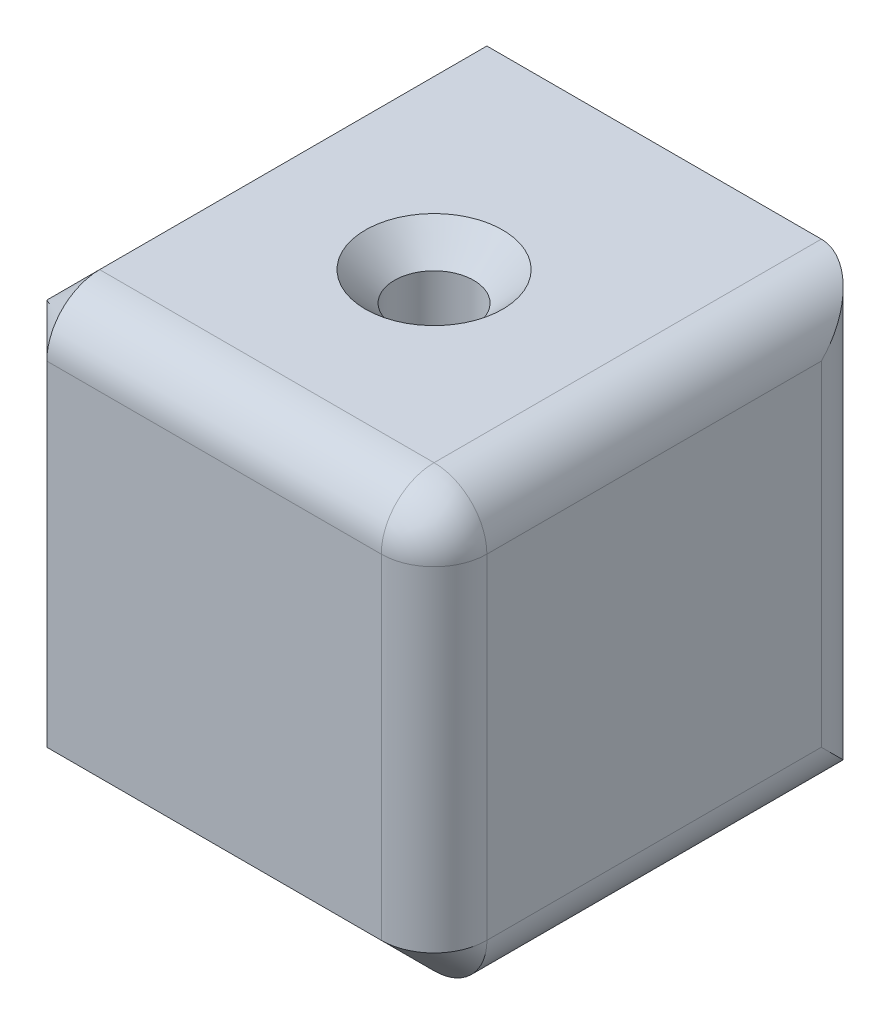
ISO-10303-21;
HEADER;
FILE_DESCRIPTION(('STEP AP214'),'2;1');
FILE_NAME('part.step','',(''),(''),'','','');
FILE_SCHEMA(('AUTOMOTIVE_DESIGN { 1 0 10303 214 1 1 1 1 }'));
ENDSEC;
DATA;
#1=APPLICATION_CONTEXT('core data for automotive mechanical design processes');
#2=APPLICATION_PROTOCOL_DEFINITION('international standard','automotive_design',2000,#1);
#3=PRODUCT_CONTEXT('',#1,'mechanical');
#4=PRODUCT('Part','Part','',(#3));
#5=PRODUCT_RELATED_PRODUCT_CATEGORY('part','',(#4));
#6=PRODUCT_DEFINITION_FORMATION('','',#4);
#7=PRODUCT_DEFINITION_CONTEXT('part definition',#1,'design');
#8=PRODUCT_DEFINITION('design','',#6,#7);
#9=PRODUCT_DEFINITION_SHAPE('','',#8);
#10=(LENGTH_UNIT() NAMED_UNIT(*) SI_UNIT(.MILLI.,.METRE.));
#11=(NAMED_UNIT(*) PLANE_ANGLE_UNIT() SI_UNIT($,.RADIAN.));
#12=(NAMED_UNIT(*) SI_UNIT($,.STERADIAN.) SOLID_ANGLE_UNIT());
#13=UNCERTAINTY_MEASURE_WITH_UNIT(LENGTH_MEASURE(1.E-05),#10,'distance_accuracy_value','');
#14=(GEOMETRIC_REPRESENTATION_CONTEXT(3) GLOBAL_UNCERTAINTY_ASSIGNED_CONTEXT((#13)) GLOBAL_UNIT_ASSIGNED_CONTEXT((#10,
#11,#12)) REPRESENTATION_CONTEXT('',''));
#15=CARTESIAN_POINT('',(0.,0.,0.));
#16=DIRECTION('',(0.,0.,1.));
#17=DIRECTION('',(1.,0.,0.));
#18=AXIS2_PLACEMENT_3D('',#15,#16,#17);
#19=CARTESIAN_POINT('',(0.,0.,25.));
#20=DIRECTION('',(1.,0.,0.));
#21=DIRECTION('',(0.,0.,-1.));
#22=AXIS2_PLACEMENT_3D('',#19,#20,#21);
#23=PLANE('',#22);
#24=DIRECTION('',(0.,0.,-1.));
#25=VECTOR('',#24,1.);
#26=CARTESIAN_POINT('',(0.,22.,25.));
#27=LINE('',#26,#25);
#28=CARTESIAN_POINT('',(0.,22.,22.));
#29=VERTEX_POINT('',#28);
#30=CARTESIAN_POINT('',(0.,22.,2.));
#31=VERTEX_POINT('',#30);
#32=EDGE_CURVE('E206',#29,#31,#27,.T.);
#33=ORIENTED_EDGE('',*,*,#32,.T.);
#34=CARTESIAN_POINT('',(0.,72.,2.));
#35=CARTESIAN_POINT('',(0.,55.3333333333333,2.));
#36=CARTESIAN_POINT('',(0.,38.6666666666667,2.));
#37=CARTESIAN_POINT('',(0.,22.,2.));
#38=CARTESIAN_POINT('',(0.,18.3333333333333,2.));
#39=CARTESIAN_POINT('',(0.,14.6666666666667,2.5));
#40=CARTESIAN_POINT('',(0.,11.,3.));
#41=CARTESIAN_POINT('',(0.,7.33333333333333,3.5));
#42=CARTESIAN_POINT('',(0.,3.66666666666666,4.));
#43=CARTESIAN_POINT('',(0.,0.,4.));
#44=CARTESIAN_POINT('',(0.,-16.,4.));
#45=CARTESIAN_POINT('',(0.,-32.,4.));
#46=CARTESIAN_POINT('',(0.,-48.,4.));
#47=(BOUNDED_CURVE() B_SPLINE_CURVE(3,(#34,#35,#36,#37,#38,#39,#40,#41,#42,#43,#44,#45,#46),
.UNSPECIFIED.,.F.,.F.) B_SPLINE_CURVE_WITH_KNOTS((4,3,3,3,4),(-0.072,-0.022,-0.011,0.,0.048),
.UNSPECIFIED.) CURVE() GEOMETRIC_REPRESENTATION_ITEM() RATIONAL_B_SPLINE_CURVE((1.,1.,1.,1.,1.,
1.,1.,1.,1.,1.,1.,1.,1.)) REPRESENTATION_ITEM(''));
#48=CARTESIAN_POINT('',(0.,0.,4.));
#49=VERTEX_POINT('',#48);
#50=EDGE_CURVE('E333',#31,#49,#47,.T.);
#51=ORIENTED_EDGE('',*,*,#50,.T.);
#52=DIRECTION('',(0.,0.,-1.));
#53=VECTOR('',#52,1.);
#54=CARTESIAN_POINT('',(0.,0.,25.));
#55=LINE('',#54,#53);
#56=CARTESIAN_POINT('',(0.,0.,22.));
#57=VERTEX_POINT('',#56);
#58=EDGE_CURVE('E151',#57,#49,#55,.T.);
#59=ORIENTED_EDGE('',*,*,#58,.F.);
#60=DIRECTION('',(0.,1.,0.));
#61=VECTOR('',#60,1.);
#62=CARTESIAN_POINT('',(0.,0.,22.));
#63=LINE('',#62,#61);
#64=EDGE_CURVE('E187',#57,#29,#63,.T.);
#65=ORIENTED_EDGE('',*,*,#64,.T.);
#66=EDGE_LOOP('',(#33,#51,#59,#65));
#67=FACE_BOUND('',#66,.T.);
#68=ADVANCED_FACE('F43',(#67),#23,.F.);
#69=CARTESIAN_POINT('',(0.,0.,25.));
#70=DIRECTION('',(0.,1.,0.));
#71=DIRECTION('',(0.,0.,1.));
#72=AXIS2_PLACEMENT_3D('',#69,#70,#71);
#73=PLANE('',#72);
#74=CARTESIAN_POINT('',(12.5,0.,12.5));
#75=DIRECTION('',(0.,1.,0.));
#76=DIRECTION('',(0.,0.,1.));
#77=AXIS2_PLACEMENT_3D('',#74,#75,#76);
#78=CIRCLE('',#77,2.25);
#79=CARTESIAN_POINT('',(12.5,0.,14.75));
#80=VERTEX_POINT('',#79);
#81=EDGE_CURVE('E234',#80,#80,#78,.T.);
#82=ORIENTED_EDGE('',*,*,#81,.T.);
#83=EDGE_LOOP('',(#82));
#84=FACE_BOUND('',#83,.T.);
#85=ORIENTED_EDGE('',*,*,#58,.T.);
#86=CARTESIAN_POINT('',(0.,0.,4.));
#87=CARTESIAN_POINT('',(-1.07801650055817E-05,0.,3.88749351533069));
#88=CARTESIAN_POINT('',(0.00474660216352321,0.,3.77499214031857));
#89=CARTESIAN_POINT('',(0.0237142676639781,0.,3.55079431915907));
#90=CARTESIAN_POINT('',(0.0379240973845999,0.,3.43909783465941));
#91=CARTESIAN_POINT('',(0.075698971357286,0.,3.2173773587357));
#92=CARTESIAN_POINT('',(0.0992569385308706,0.,3.10735216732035));
#93=CARTESIAN_POINT('',(0.155536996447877,0.,2.88970424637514));
#94=CARTESIAN_POINT('',(0.188258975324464,0.,2.78208148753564));
#95=CARTESIAN_POINT('',(0.299906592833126,0.,2.4638552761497));
#96=CARTESIAN_POINT('',(0.392329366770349,0.,2.2578036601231));
#97=CARTESIAN_POINT('',(0.610395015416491,0.,1.8642930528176));
#98=CARTESIAN_POINT('',(0.73603203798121,0.,1.67683079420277));
#99=CARTESIAN_POINT('',(1.01700181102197,0.,1.325628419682));
#100=CARTESIAN_POINT('',(1.17233427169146,0.,1.16188807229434));
#101=CARTESIAN_POINT('',(1.50831732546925,0.,0.862784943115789));
#102=CARTESIAN_POINT('',(1.68897286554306,0.,0.727427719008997));
#103=CARTESIAN_POINT('',(2.07046311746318,0.,0.488943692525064));
#104=CARTESIAN_POINT('',(2.27130176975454,0.,0.38582320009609));
#105=CARTESIAN_POINT('',(2.68740125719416,0.,0.214817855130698));
#106=CARTESIAN_POINT('',(2.90265356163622,0.,0.146912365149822));
#107=CARTESIAN_POINT('',(3.2660192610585,0.,0.0651394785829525));
#108=CARTESIAN_POINT('',(3.41184681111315,0.,0.0407269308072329));
#109=CARTESIAN_POINT('',(3.70509586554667,0.,0.00815932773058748));
#110=CARTESIAN_POINT('',(3.8525148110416,0.,-1.87754480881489E-05));
#111=CARTESIAN_POINT('',(4.,0.,0.));
#112=B_SPLINE_CURVE_WITH_KNOTS('',3,(#86,#87,#88,#89,#90,#91,#92,#93,#94,#95,#96,#97,#98,#99,
#100,#101,#102,#103,#104,#105,#106,#107,#108,#109,#110,#111),.UNSPECIFIED.,.F.,.F.,(4,2,2,2,2,2,
2,2,2,2,2,2,4),(0.,0.337409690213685,0.674803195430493,1.01194176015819,1.34907620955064,
2.0230739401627,2.69695299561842,3.37082547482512,4.04482978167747,4.71896593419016,
5.39270656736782,5.83543557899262,6.27753560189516),.UNSPECIFIED.);
#113=CARTESIAN_POINT('',(4.,0.,0.));
#114=VERTEX_POINT('',#113);
#115=EDGE_CURVE('E75',#49,#114,#112,.T.);
#116=ORIENTED_EDGE('',*,*,#115,.T.);
#117=DIRECTION('',(1.,0.,0.));
#118=VECTOR('',#117,1.);
#119=CARTESIAN_POINT('',(0.,0.,0.));
#120=LINE('',#119,#118);
#121=CARTESIAN_POINT('',(22.,0.,0.));
#122=VERTEX_POINT('',#121);
#123=EDGE_CURVE('E231',#114,#122,#120,.T.);
#124=ORIENTED_EDGE('',*,*,#123,.T.);
#125=DIRECTION('',(0.,0.,-1.));
#126=VECTOR('',#125,1.);
#127=CARTESIAN_POINT('',(22.,0.,25.));
#128=LINE('',#127,#126);
#129=CARTESIAN_POINT('',(22.,0.,22.));
#130=VERTEX_POINT('',#129);
#131=EDGE_CURVE('E136',#122,#130,#128,.F.);
#132=ORIENTED_EDGE('',*,*,#131,.T.);
#133=DIRECTION('',(-1.,0.,0.));
#134=VECTOR('',#133,1.);
#135=CARTESIAN_POINT('',(0.,0.,22.));
#136=LINE('',#135,#134);
#137=EDGE_CURVE('E344',#130,#57,#136,.T.);
#138=ORIENTED_EDGE('',*,*,#137,.T.);
#139=EDGE_LOOP('',(#85,#116,#124,#132,#138));
#140=FACE_BOUND('',#139,.T.);
#141=ADVANCED_FACE('F356',(#84,#140),#73,.F.);
#142=CARTESIAN_POINT('',(25.,0.,25.));
#143=DIRECTION('',(-1.,0.,0.));
#144=DIRECTION('',(0.,0.,1.));
#145=AXIS2_PLACEMENT_3D('',#142,#143,#144);
#146=PLANE('',#145);
#147=DIRECTION('',(0.,1.,0.));
#148=VECTOR('',#147,1.);
#149=CARTESIAN_POINT('',(25.,0.,22.));
#150=LINE('',#149,#148);
#151=CARTESIAN_POINT('',(25.,22.,22.));
#152=VERTEX_POINT('',#151);
#153=CARTESIAN_POINT('',(25.,3.,22.));
#154=VERTEX_POINT('',#153);
#155=EDGE_CURVE('E156',#152,#154,#150,.F.);
#156=ORIENTED_EDGE('',*,*,#155,.T.);
#157=DIRECTION('',(0.,0.,-1.));
#158=VECTOR('',#157,1.);
#159=CARTESIAN_POINT('',(25.,3.,25.));
#160=LINE('',#159,#158);
#161=CARTESIAN_POINT('',(25.,3.,3.));
#162=VERTEX_POINT('',#161);
#163=EDGE_CURVE('E133',#154,#162,#160,.T.);
#164=ORIENTED_EDGE('',*,*,#163,.T.);
#165=DIRECTION('',(0.,1.,0.));
#166=VECTOR('',#165,1.);
#167=CARTESIAN_POINT('',(25.,25.,3.));
#168=LINE('',#167,#166);
#169=CARTESIAN_POINT('',(25.,22.,3.));
#170=VERTEX_POINT('',#169);
#171=EDGE_CURVE('E144',#162,#170,#168,.T.);
#172=ORIENTED_EDGE('',*,*,#171,.T.);
#173=DIRECTION('',(0.,0.,-1.));
#174=VECTOR('',#173,1.);
#175=CARTESIAN_POINT('',(25.,22.,25.));
#176=LINE('',#175,#174);
#177=EDGE_CURVE('E150',#170,#152,#176,.F.);
#178=ORIENTED_EDGE('',*,*,#177,.T.);
#179=EDGE_LOOP('',(#156,#164,#172,#178));
#180=FACE_BOUND('',#179,.T.);
#181=ADVANCED_FACE('F154',(#180),#146,.F.);
#182=CARTESIAN_POINT('',(0.,25.,25.));
#183=DIRECTION('',(0.,-1.,0.));
#184=DIRECTION('',(0.,0.,-1.));
#185=AXIS2_PLACEMENT_3D('',#182,#183,#184);
#186=PLANE('',#185);
#187=CARTESIAN_POINT('',(12.5,25.,12.5));
#188=DIRECTION('',(0.,1.,0.));
#189=DIRECTION('',(0.,0.,1.));
#190=AXIS2_PLACEMENT_3D('',#187,#188,#189);
#191=CIRCLE('',#190,3.9);
#192=CARTESIAN_POINT('',(12.5,25.,16.4));
#193=VERTEX_POINT('',#192);
#194=EDGE_CURVE('E203',#193,#193,#191,.T.);
#195=ORIENTED_EDGE('',*,*,#194,.F.);
#196=EDGE_LOOP('',(#195));
#197=FACE_BOUND('',#196,.T.);
#198=DIRECTION('',(-1.,0.,0.));
#199=VECTOR('',#198,1.);
#200=CARTESIAN_POINT('',(0.,25.,0.));
#201=LINE('',#200,#199);
#202=CARTESIAN_POINT('',(22.,25.,0.));
#203=VERTEX_POINT('',#202);
#204=CARTESIAN_POINT('',(3.00000000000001,25.,0.));
#205=VERTEX_POINT('',#204);
#206=EDGE_CURVE('E227',#203,#205,#201,.T.);
#207=ORIENTED_EDGE('',*,*,#206,.T.);
#208=DIRECTION('',(0.,0.,1.));
#209=VECTOR('',#208,1.);
#210=CARTESIAN_POINT('',(3.00000000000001,25.,25.));
#211=LINE('',#210,#209);
#212=CARTESIAN_POINT('',(3.00000000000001,25.,22.));
#213=VERTEX_POINT('',#212);
#214=EDGE_CURVE('E213',#205,#213,#211,.T.);
#215=ORIENTED_EDGE('',*,*,#214,.T.);
#216=DIRECTION('',(-1.,0.,0.));
#217=VECTOR('',#216,1.);
#218=CARTESIAN_POINT('',(0.,25.,22.));
#219=LINE('',#218,#217);
#220=CARTESIAN_POINT('',(22.,25.,22.));
#221=VERTEX_POINT('',#220);
#222=EDGE_CURVE('E173',#213,#221,#219,.F.);
#223=ORIENTED_EDGE('',*,*,#222,.T.);
#224=DIRECTION('',(0.,0.,-1.));
#225=VECTOR('',#224,1.);
#226=CARTESIAN_POINT('',(22.,25.,25.));
#227=LINE('',#226,#225);
#228=EDGE_CURVE('E181',#221,#203,#227,.T.);
#229=ORIENTED_EDGE('',*,*,#228,.T.);
#230=EDGE_LOOP('',(#207,#215,#223,#229));
#231=FACE_BOUND('',#230,.T.);
#232=ADVANCED_FACE('F248',(#197,#231),#186,.F.);
#233=CARTESIAN_POINT('',(0.,0.,25.));
#234=DIRECTION('',(0.,0.,-1.));
#235=DIRECTION('',(-1.,0.,0.));
#236=AXIS2_PLACEMENT_3D('',#233,#234,#235);
#237=PLANE('',#236);
#238=DIRECTION('',(-1.,0.,0.));
#239=VECTOR('',#238,1.);
#240=CARTESIAN_POINT('',(0.,22.,25.));
#241=LINE('',#240,#239);
#242=CARTESIAN_POINT('',(22.,22.,25.));
#243=VERTEX_POINT('',#242);
#244=CARTESIAN_POINT('',(3.00000000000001,22.,25.));
#245=VERTEX_POINT('',#244);
#246=EDGE_CURVE('E161',#243,#245,#241,.T.);
#247=ORIENTED_EDGE('',*,*,#246,.T.);
#248=DIRECTION('',(0.,-1.,0.));
#249=VECTOR('',#248,1.);
#250=CARTESIAN_POINT('',(3.00000000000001,0.,25.));
#251=LINE('',#250,#249);
#252=CARTESIAN_POINT('',(3.00000000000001,3.00000000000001,25.));
#253=VERTEX_POINT('',#252);
#254=EDGE_CURVE('E395',#245,#253,#251,.T.);
#255=ORIENTED_EDGE('',*,*,#254,.T.);
#256=DIRECTION('',(1.,0.,0.));
#257=VECTOR('',#256,1.);
#258=CARTESIAN_POINT('',(0.,3.00000000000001,25.));
#259=LINE('',#258,#257);
#260=CARTESIAN_POINT('',(22.,3.00000000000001,25.));
#261=VERTEX_POINT('',#260);
#262=EDGE_CURVE('E387',#253,#261,#259,.T.);
#263=ORIENTED_EDGE('',*,*,#262,.T.);
#264=DIRECTION('',(0.,1.,0.));
#265=VECTOR('',#264,1.);
#266=CARTESIAN_POINT('',(22.,0.,25.));
#267=LINE('',#266,#265);
#268=EDGE_CURVE('E169',#261,#243,#267,.T.);
#269=ORIENTED_EDGE('',*,*,#268,.T.);
#270=EDGE_LOOP('',(#247,#255,#263,#269));
#271=FACE_BOUND('',#270,.T.);
#272=ADVANCED_FACE('F251',(#271),#237,.F.);
#273=CARTESIAN_POINT('',(0.,0.,0.));
#274=DIRECTION('',(0.,0.,-1.));
#275=DIRECTION('',(-1.,0.,0.));
#276=AXIS2_PLACEMENT_3D('',#273,#274,#275);
#277=PLANE('',#276);
#278=ORIENTED_EDGE('',*,*,#123,.F.);
#279=CARTESIAN_POINT('',(2.,72.,0.));
#280=CARTESIAN_POINT('',(2.,55.3333333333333,0.));
#281=CARTESIAN_POINT('',(2.,38.6666666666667,0.));
#282=CARTESIAN_POINT('',(2.,22.,0.));
#283=CARTESIAN_POINT('',(2.,18.3333333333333,0.));
#284=CARTESIAN_POINT('',(2.5,14.6666666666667,0.));
#285=CARTESIAN_POINT('',(3.,11.,0.));
#286=CARTESIAN_POINT('',(3.5,7.33333333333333,0.));
#287=CARTESIAN_POINT('',(4.,3.66666666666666,0.));
#288=CARTESIAN_POINT('',(4.,0.,0.));
#289=CARTESIAN_POINT('',(4.,-16.,0.));
#290=CARTESIAN_POINT('',(4.,-32.,0.));
#291=CARTESIAN_POINT('',(4.,-48.,0.));
#292=(BOUNDED_CURVE() B_SPLINE_CURVE(3,(#279,#280,#281,#282,#283,#284,#285,#286,#287,#288,#289,
#290,#291),.UNSPECIFIED.,.F.,.F.) B_SPLINE_CURVE_WITH_KNOTS((4,3,3,3,4),(-0.072,-0.022,-0.011,
0.,0.048),.UNSPECIFIED.) CURVE() GEOMETRIC_REPRESENTATION_ITEM() RATIONAL_B_SPLINE_CURVE((1.,1.,
1.,1.,1.,1.,1.,1.,1.,1.,1.,1.,1.)) REPRESENTATION_ITEM(''));
#293=CARTESIAN_POINT('',(2.,24.,0.));
#294=VERTEX_POINT('',#293);
#295=EDGE_CURVE('E61',#114,#294,#292,.F.);
#296=ORIENTED_EDGE('',*,*,#295,.T.);
#297=DIRECTION('',(-0.707106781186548,-0.707106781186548,0.));
#298=VECTOR('',#297,1.);
#299=CARTESIAN_POINT('',(-11.,11.,0.));
#300=LINE('',#299,#298);
#301=EDGE_CURVE('E210',#294,#205,#300,.F.);
#302=ORIENTED_EDGE('',*,*,#301,.T.);
#303=ORIENTED_EDGE('',*,*,#206,.F.);
#304=DIRECTION('',(0.,1.,0.));
#305=VECTOR('',#304,1.);
#306=CARTESIAN_POINT('',(22.,0.,0.));
#307=LINE('',#306,#305);
#308=EDGE_CURVE('E184',#203,#122,#307,.F.);
#309=ORIENTED_EDGE('',*,*,#308,.T.);
#310=EDGE_LOOP('',(#278,#296,#302,#303,#309));
#311=FACE_BOUND('',#310,.T.);
#312=ADVANCED_FACE('F423',(#311),#277,.T.);
#313=CARTESIAN_POINT('',(12.5,25.,12.5));
#314=DIRECTION('',(0.,1.,0.));
#315=DIRECTION('',(0.,0.,1.));
#316=AXIS2_PLACEMENT_3D('',#313,#314,#315);
#317=CYLINDRICAL_SURFACE('',#316,2.25);
#318=ORIENTED_EDGE('',*,*,#81,.F.);
#319=EDGE_LOOP('',(#318));
#320=FACE_BOUND('',#319,.T.);
#321=CARTESIAN_POINT('',(12.5,23.35,12.5));
#322=DIRECTION('',(0.,1.,0.));
#323=DIRECTION('',(0.,0.,1.));
#324=AXIS2_PLACEMENT_3D('',#321,#322,#323);
#325=CIRCLE('',#324,2.25);
#326=CARTESIAN_POINT('',(12.5,23.35,14.75));
#327=VERTEX_POINT('',#326);
#328=EDGE_CURVE('E238',#327,#327,#325,.T.);
#329=ORIENTED_EDGE('',*,*,#328,.T.);
#330=EDGE_LOOP('',(#329));
#331=FACE_BOUND('',#330,.T.);
#332=ADVANCED_FACE('F496',(#320,#331),#317,.F.);
#333=CARTESIAN_POINT('',(12.5,25.,12.5));
#334=DIRECTION('',(0.,1.,0.));
#335=DIRECTION('',(0.,0.,1.));
#336=AXIS2_PLACEMENT_3D('',#333,#334,#335);
#337=CONICAL_SURFACE('',#336,3.9,0.785398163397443);
#338=ORIENTED_EDGE('',*,*,#328,.F.);
#339=EDGE_LOOP('',(#338));
#340=FACE_BOUND('',#339,.T.);
#341=ORIENTED_EDGE('',*,*,#194,.T.);
#342=EDGE_LOOP('',(#341));
#343=FACE_BOUND('',#342,.T.);
#344=ADVANCED_FACE('F246',(#340,#343),#337,.F.);
#345=CARTESIAN_POINT('',(0.,22.,22.));
#346=DIRECTION('',(-1.,0.,0.));
#347=DIRECTION('',(0.,0.,1.));
#348=AXIS2_PLACEMENT_3D('',#345,#346,#347);
#349=CYLINDRICAL_SURFACE('',#348,3.);
#350=ORIENTED_EDGE('',*,*,#222,.F.);
#351=CARTESIAN_POINT('',(3.00000000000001,22.,22.));
#352=DIRECTION('',(1.,0.,0.));
#353=DIRECTION('',(0.,0.,-1.));
#354=AXIS2_PLACEMENT_3D('',#351,#352,#353);
#355=CIRCLE('',#354,3.);
#356=EDGE_CURVE('E216',#213,#245,#355,.T.);
#357=ORIENTED_EDGE('',*,*,#356,.T.);
#358=ORIENTED_EDGE('',*,*,#246,.F.);
#359=CARTESIAN_POINT('',(22.,22.,22.));
#360=DIRECTION('',(1.,0.,0.));
#361=DIRECTION('',(0.,0.,-1.));
#362=AXIS2_PLACEMENT_3D('',#359,#360,#361);
#363=CIRCLE('',#362,3.);
#364=EDGE_CURVE('E199',#221,#243,#363,.T.);
#365=ORIENTED_EDGE('',*,*,#364,.F.);
#366=EDGE_LOOP('',(#350,#357,#358,#365));
#367=FACE_BOUND('',#366,.T.);
#368=ADVANCED_FACE('F411',(#367),#349,.T.);
#369=CARTESIAN_POINT('',(22.,22.,22.));
#370=DIRECTION('',(0.,0.,1.));
#371=DIRECTION('',(1.,0.,0.));
#372=AXIS2_PLACEMENT_3D('',#369,#370,#371);
#373=SPHERICAL_SURFACE('',#372,3.);
#374=CARTESIAN_POINT('',(22.,22.,22.));
#375=DIRECTION('',(0.,1.,0.));
#376=DIRECTION('',(0.,0.,1.));
#377=AXIS2_PLACEMENT_3D('',#374,#375,#376);
#378=CIRCLE('',#377,3.);
#379=EDGE_CURVE('E191',#152,#243,#378,.F.);
#380=ORIENTED_EDGE('',*,*,#379,.F.);
#381=CARTESIAN_POINT('',(22.,22.,22.));
#382=DIRECTION('',(0.,0.,1.));
#383=DIRECTION('',(1.,0.,0.));
#384=AXIS2_PLACEMENT_3D('',#381,#382,#383);
#385=CIRCLE('',#384,3.);
#386=EDGE_CURVE('E195',#221,#152,#385,.F.);
#387=ORIENTED_EDGE('',*,*,#386,.F.);
#388=ORIENTED_EDGE('',*,*,#364,.T.);
#389=EDGE_LOOP('',(#380,#387,#388));
#390=FACE_BOUND('',#389,.T.);
#391=ADVANCED_FACE('F421',(#390),#373,.T.);
#392=CARTESIAN_POINT('',(22.,22.,25.));
#393=DIRECTION('',(0.,0.,-1.));
#394=DIRECTION('',(-1.,0.,0.));
#395=AXIS2_PLACEMENT_3D('',#392,#393,#394);
#396=CYLINDRICAL_SURFACE('',#395,3.);
#397=ORIENTED_EDGE('',*,*,#386,.T.);
#398=ORIENTED_EDGE('',*,*,#177,.F.);
#399=CARTESIAN_POINT('',(22.,22.,3.));
#400=DIRECTION('',(0.,-0.707106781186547,-0.707106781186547));
#401=DIRECTION('',(0.,-0.707106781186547,0.707106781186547));
#402=AXIS2_PLACEMENT_3D('',#399,#400,#401);
#403=ELLIPSE('',#402,4.24264068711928,3.);
#404=EDGE_CURVE('E140',#203,#170,#403,.T.);
#405=ORIENTED_EDGE('',*,*,#404,.F.);
#406=ORIENTED_EDGE('',*,*,#228,.F.);
#407=EDGE_LOOP('',(#397,#398,#405,#406));
#408=FACE_BOUND('',#407,.T.);
#409=ADVANCED_FACE('F381',(#408),#396,.T.);
#410=CARTESIAN_POINT('',(22.,0.,22.));
#411=DIRECTION('',(0.,1.,0.));
#412=DIRECTION('',(0.,0.,1.));
#413=AXIS2_PLACEMENT_3D('',#410,#411,#412);
#414=CYLINDRICAL_SURFACE('',#413,3.);
#415=ORIENTED_EDGE('',*,*,#268,.F.);
#416=CARTESIAN_POINT('',(25.,3.,22.));
#417=CARTESIAN_POINT('',(25.,3.,22.2778977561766));
#418=CARTESIAN_POINT('',(24.9603489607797,3.,22.554878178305));
#419=CARTESIAN_POINT('',(24.815474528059,3.,23.0698873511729));
#420=CARTESIAN_POINT('',(24.7109932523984,3.,23.3073564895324));
#421=CARTESIAN_POINT('',(24.4661440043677,3.,23.7253403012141));
#422=CARTESIAN_POINT('',(24.3262255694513,3.,23.9062260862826));
#423=CARTESIAN_POINT('',(24.0347585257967,3.,24.2146740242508));
#424=CARTESIAN_POINT('',(23.883200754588,3.,24.34261059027));
#425=CARTESIAN_POINT('',(23.5809008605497,3.,24.5563688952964));
#426=CARTESIAN_POINT('',(23.4300193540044,3.,24.6423472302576));
#427=CARTESIAN_POINT('',(23.1331336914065,3.,24.7826178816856));
#428=CARTESIAN_POINT('',(22.9870236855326,3.,24.8369397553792));
#429=CARTESIAN_POINT('',(22.5557143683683,3.,24.9632673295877));
#430=CARTESIAN_POINT('',(22.2775127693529,3.,25.));
#431=CARTESIAN_POINT('',(22.,3.,25.));
#432=B_SPLINE_CURVE_WITH_KNOTS('',3,(#416,#417,#418,#419,#420,#421,#422,#423,#424,#425,#426,
#427,#428,#429,#430,#431),.UNSPECIFIED.,.F.,.F.,(4,2,2,2,2,2,2,4),(1.5707963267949,
1.76714586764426,1.96349540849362,2.15984494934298,2.35619449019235,2.55254403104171,
2.74889357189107,3.14159265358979),.UNSPECIFIED.);
#433=EDGE_CURVE('E329',#261,#154,#432,.F.);
#434=ORIENTED_EDGE('',*,*,#433,.T.);
#435=ORIENTED_EDGE('',*,*,#155,.F.);
#436=ORIENTED_EDGE('',*,*,#379,.T.);
#437=EDGE_LOOP('',(#415,#434,#435,#436));
#438=FACE_BOUND('',#437,.T.);
#439=ADVANCED_FACE('F377',(#438),#414,.T.);
#440=CARTESIAN_POINT('',(22.,0.,3.));
#441=DIRECTION('',(0.,-1.,0.));
#442=DIRECTION('',(0.,0.,-1.));
#443=AXIS2_PLACEMENT_3D('',#440,#441,#442);
#444=CYLINDRICAL_SURFACE('',#443,3.);
#445=ORIENTED_EDGE('',*,*,#404,.T.);
#446=ORIENTED_EDGE('',*,*,#171,.F.);
#447=CARTESIAN_POINT('',(22.,3.,3.));
#448=DIRECTION('',(0.,-0.707106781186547,0.707106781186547));
#449=DIRECTION('',(0.,-0.707106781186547,-0.707106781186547));
#450=AXIS2_PLACEMENT_3D('',#447,#448,#449);
#451=ELLIPSE('',#450,4.24264068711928,3.);
#452=EDGE_CURVE('E129',#122,#162,#451,.T.);
#453=ORIENTED_EDGE('',*,*,#452,.F.);
#454=ORIENTED_EDGE('',*,*,#308,.F.);
#455=EDGE_LOOP('',(#445,#446,#453,#454));
#456=FACE_BOUND('',#455,.T.);
#457=ADVANCED_FACE('F145',(#456),#444,.T.);
#458=CARTESIAN_POINT('',(22.,3.,25.));
#459=DIRECTION('',(0.,0.,-1.));
#460=DIRECTION('',(-1.,0.,0.));
#461=AXIS2_PLACEMENT_3D('',#458,#459,#460);
#462=CYLINDRICAL_SURFACE('',#461,3.);
#463=ORIENTED_EDGE('',*,*,#163,.F.);
#464=CARTESIAN_POINT('',(22.,0.,22.));
#465=CARTESIAN_POINT('',(22.2775127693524,0.,22.));
#466=CARTESIAN_POINT('',(22.555714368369,0.0367326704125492,22.));
#467=CARTESIAN_POINT('',(22.9870236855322,0.163060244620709,22.));
#468=CARTESIAN_POINT('',(23.1331336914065,0.217382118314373,22.));
#469=CARTESIAN_POINT('',(23.4300193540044,0.357652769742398,22.));
#470=CARTESIAN_POINT('',(23.5809008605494,0.443631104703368,22.));
#471=CARTESIAN_POINT('',(23.8832007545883,0.657389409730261,22.));
#472=CARTESIAN_POINT('',(24.0347585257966,0.785325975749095,22.));
#473=CARTESIAN_POINT('',(24.3262255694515,1.09377391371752,22.));
#474=CARTESIAN_POINT('',(24.4661440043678,1.2746596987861,22.));
#475=CARTESIAN_POINT('',(24.7109932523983,1.69264351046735,22.));
#476=CARTESIAN_POINT('',(24.8154745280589,1.93011264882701,22.));
#477=CARTESIAN_POINT('',(24.9603489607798,2.44512182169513,22.));
#478=CARTESIAN_POINT('',(25.,2.72210224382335,22.));
#479=CARTESIAN_POINT('',(25.,2.99999999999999,22.));
#480=B_SPLINE_CURVE_WITH_KNOTS('',3,(#464,#465,#466,#467,#468,#469,#470,#471,#472,#473,#474,
#475,#476,#477,#478,#479),.UNSPECIFIED.,.F.,.F.,(4,2,2,2,2,2,2,4),(1.5707963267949,
1.96349540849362,2.15984494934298,2.35619449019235,2.55254403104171,2.74889357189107,
2.94524311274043,3.14159265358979),.UNSPECIFIED.);
#481=EDGE_CURVE('E218',#154,#130,#480,.F.);
#482=ORIENTED_EDGE('',*,*,#481,.T.);
#483=ORIENTED_EDGE('',*,*,#131,.F.);
#484=ORIENTED_EDGE('',*,*,#452,.T.);
#485=EDGE_LOOP('',(#463,#482,#483,#484));
#486=FACE_BOUND('',#485,.T.);
#487=ADVANCED_FACE('F131',(#486),#462,.T.);
#488=CARTESIAN_POINT('',(25.,2.99999999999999,22.));
#489=CARTESIAN_POINT('',(25.,2.72210224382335,22.));
#490=CARTESIAN_POINT('',(24.9603489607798,2.44512182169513,22.));
#491=CARTESIAN_POINT('',(24.8154745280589,1.93011264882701,22.));
#492=CARTESIAN_POINT('',(24.7109932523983,1.69264351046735,22.));
#493=CARTESIAN_POINT('',(24.4661440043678,1.2746596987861,22.));
#494=CARTESIAN_POINT('',(24.3262255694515,1.09377391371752,22.));
#495=CARTESIAN_POINT('',(24.0347585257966,0.785325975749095,22.));
#496=CARTESIAN_POINT('',(23.8832007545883,0.657389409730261,22.));
#497=CARTESIAN_POINT('',(23.5809008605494,0.443631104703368,22.));
#498=CARTESIAN_POINT('',(23.4300193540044,0.357652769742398,22.));
#499=CARTESIAN_POINT('',(23.1331336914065,0.217382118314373,22.));
#500=CARTESIAN_POINT('',(22.9870236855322,0.163060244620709,22.));
#501=CARTESIAN_POINT('',(22.555714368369,0.0367326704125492,22.));
#502=CARTESIAN_POINT('',(22.2775127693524,0.,22.));
#503=CARTESIAN_POINT('',(22.,0.,22.));
#504=CARTESIAN_POINT('',(25.,3.,22.));
#505=CARTESIAN_POINT('',(25.,3.,22.2778977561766));
#506=CARTESIAN_POINT('',(24.9603489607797,3.,22.554878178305));
#507=CARTESIAN_POINT('',(24.815474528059,3.,23.0698873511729));
#508=CARTESIAN_POINT('',(24.7109932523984,3.,23.3073564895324));
#509=CARTESIAN_POINT('',(24.4661440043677,3.,23.7253403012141));
#510=CARTESIAN_POINT('',(24.3262255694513,3.,23.9062260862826));
#511=CARTESIAN_POINT('',(24.0347585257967,3.,24.2146740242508));
#512=CARTESIAN_POINT('',(23.883200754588,3.,24.34261059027));
#513=CARTESIAN_POINT('',(23.5809008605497,3.,24.5563688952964));
#514=CARTESIAN_POINT('',(23.4300193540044,3.,24.6423472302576));
#515=CARTESIAN_POINT('',(23.1331336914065,3.,24.7826178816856));
#516=CARTESIAN_POINT('',(22.9870236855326,3.,24.8369397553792));
#517=CARTESIAN_POINT('',(22.5557143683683,3.,24.9632673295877));
#518=CARTESIAN_POINT('',(22.2775127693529,3.,25.));
#519=CARTESIAN_POINT('',(22.,3.,25.));
#520=B_SPLINE_SURFACE_WITH_KNOTS('',1,3,((#488,#489,#490,#491,#492,#493,#494,#495,#496,#497,
#498,#499,#500,#501,#502,#503),(#504,#505,#506,#507,#508,#509,#510,#511,#512,#513,#514,#515,
#516,#517,#518,#519)),.UNSPECIFIED.,.F.,.F.,.F.,(2,2),(4,2,2,2,2,2,2,4),(0.,1.),
(1.5707963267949,1.76714586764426,1.96349540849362,2.15984494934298,2.35619449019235,
2.55254403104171,2.74889357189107,3.14159265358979),.UNSPECIFIED.);
#521=CARTESIAN_POINT('',(22.,3.,25.));
#522=CARTESIAN_POINT('',(22.,0.,22.));
#523=B_SPLINE_CURVE_WITH_KNOTS('',1,(#521,#522),.UNSPECIFIED.,.F.,.F.,(2,2),(0.,1.),.UNSPECIFIED.);
#524=EDGE_CURVE('E141',#130,#261,#523,.F.);
#525=ORIENTED_EDGE('',*,*,#481,.F.);
#526=ORIENTED_EDGE('',*,*,#433,.F.);
#527=ORIENTED_EDGE('',*,*,#524,.F.);
#528=EDGE_LOOP('',(#525,#526,#527));
#529=FACE_BOUND('',#528,.T.);
#530=ADVANCED_FACE('F300',(#529),#520,.T.);
#531=CARTESIAN_POINT('',(0.,3.00000000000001,25.));
#532=DIRECTION('',(0.,0.707106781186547,-0.707106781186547));
#533=DIRECTION('',(1.,0.,0.));
#534=AXIS2_PLACEMENT_3D('',#531,#532,#533);
#535=PLANE('',#534);
#536=ORIENTED_EDGE('',*,*,#524,.T.);
#537=ORIENTED_EDGE('',*,*,#262,.F.);
#538=DIRECTION('',(-0.577350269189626,-0.577350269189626,-0.577350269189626));
#539=VECTOR('',#538,1.);
#540=CARTESIAN_POINT('',(2.00000000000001,2.00000000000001,24.));
#541=LINE('',#540,#539);
#542=EDGE_CURVE('E271',#57,#253,#541,.F.);
#543=ORIENTED_EDGE('',*,*,#542,.F.);
#544=ORIENTED_EDGE('',*,*,#137,.F.);
#545=EDGE_LOOP('',(#536,#537,#543,#544));
#546=FACE_BOUND('',#545,.T.);
#547=ADVANCED_FACE('F290',(#546),#535,.F.);
#548=CARTESIAN_POINT('',(3.00000000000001,0.,25.));
#549=DIRECTION('',(0.707106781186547,0.,-0.707106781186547));
#550=DIRECTION('',(0.,-1.,0.));
#551=AXIS2_PLACEMENT_3D('',#548,#549,#550);
#552=PLANE('',#551);
#553=ORIENTED_EDGE('',*,*,#542,.T.);
#554=ORIENTED_EDGE('',*,*,#254,.F.);
#555=DIRECTION('',(0.707106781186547,0.,0.707106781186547));
#556=VECTOR('',#555,1.);
#557=CARTESIAN_POINT('',(0.,22.,22.));
#558=LINE('',#557,#556);
#559=EDGE_CURVE('E268',#29,#245,#558,.T.);
#560=ORIENTED_EDGE('',*,*,#559,.F.);
#561=ORIENTED_EDGE('',*,*,#64,.F.);
#562=EDGE_LOOP('',(#553,#554,#560,#561));
#563=FACE_BOUND('',#562,.T.);
#564=ADVANCED_FACE('F299',(#563),#552,.F.);
#565=CARTESIAN_POINT('',(3.00000000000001,22.,22.));
#566=DIRECTION('',(1.,0.,0.));
#567=DIRECTION('',(0.,0.,-1.));
#568=AXIS2_PLACEMENT_3D('',#565,#566,#567);
#569=CONICAL_SURFACE('',#568,3.00000000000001,0.785398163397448);
#570=ORIENTED_EDGE('',*,*,#559,.T.);
#571=ORIENTED_EDGE('',*,*,#356,.F.);
#572=DIRECTION('',(0.707106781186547,0.707106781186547,0.));
#573=VECTOR('',#572,1.);
#574=CARTESIAN_POINT('',(0.,22.,22.));
#575=LINE('',#574,#573);
#576=EDGE_CURVE('E263',#29,#213,#575,.T.);
#577=ORIENTED_EDGE('',*,*,#576,.F.);
#578=EDGE_LOOP('',(#570,#571,#577));
#579=FACE_BOUND('',#578,.T.);
#580=ADVANCED_FACE('F407',(#579),#569,.T.);
#581=CARTESIAN_POINT('',(0.,22.,25.));
#582=DIRECTION('',(0.707106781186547,-0.707106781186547,0.));
#583=DIRECTION('',(0.,0.,-1.));
#584=AXIS2_PLACEMENT_3D('',#581,#582,#583);
#585=PLANE('',#584);
#586=ORIENTED_EDGE('',*,*,#301,.F.);
#587=CARTESIAN_POINT('',(2.,24.,0.));
#588=CARTESIAN_POINT('',(1.92345690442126,23.9234569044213,2.13639570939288E-05));
#589=CARTESIAN_POINT('',(1.84690398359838,23.8469039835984,0.00439570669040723));
#590=CARTESIAN_POINT('',(1.69420371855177,23.6942037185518,0.0220142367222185));
#591=CARTESIAN_POINT('',(1.61805709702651,23.6180570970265,0.0352709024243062));
#592=CARTESIAN_POINT('',(1.46607034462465,23.4660703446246,0.070993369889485));
#593=CARTESIAN_POINT('',(1.39024057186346,23.3902405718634,0.0935483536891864));
#594=CARTESIAN_POINT('',(1.24036607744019,23.2403660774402,0.148159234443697));
#595=CARTESIAN_POINT('',(1.16632018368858,23.1663201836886,0.180208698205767));
#596=CARTESIAN_POINT('',(0.992048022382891,22.9920480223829,0.26881498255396));
#597=CARTESIAN_POINT('',(0.892979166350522,22.8929791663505,0.330052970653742));
#598=CARTESIAN_POINT('',(0.702814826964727,22.7028148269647,0.473105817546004));
#599=CARTESIAN_POINT('',(0.611692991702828,22.6116929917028,0.554848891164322));
#600=CARTESIAN_POINT('',(0.463419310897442,22.4634193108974,0.716398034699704));
#601=CARTESIAN_POINT('',(0.40357525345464,22.4035752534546,0.791242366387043));
#602=CARTESIAN_POINT('',(0.292904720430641,22.2929047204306,0.953373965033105));
#603=CARTESIAN_POINT('',(0.242069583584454,22.2420695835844,1.04064913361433));
#604=CARTESIAN_POINT('',(0.161607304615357,22.1616073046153,1.20809567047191));
#605=CARTESIAN_POINT('',(0.129770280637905,22.1297702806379,1.28613468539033));
#606=CARTESIAN_POINT('',(0.0756483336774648,22.0756483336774,1.44849886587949));
#607=CARTESIAN_POINT('',(0.053342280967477,22.0533422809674,1.53280963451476));
#608=CARTESIAN_POINT('',(0.0245781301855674,22.0245781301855,1.68111614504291));
#609=CARTESIAN_POINT('',(0.0154171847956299,22.0154171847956,1.74407121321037));
#610=CARTESIAN_POINT('',(0.0061966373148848,22.0061966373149,1.83945435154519));
#611=CARTESIAN_POINT('',(0.00387652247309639,22.0038765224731,1.87146513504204));
#612=CARTESIAN_POINT('',(0.000776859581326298,22.0007768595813,1.93564784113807));
#613=CARTESIAN_POINT('',(-2.08842714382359E-06,21.9999979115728,1.96781982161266));
#614=CARTESIAN_POINT('',(0.,22.,2.));
#615=B_SPLINE_CURVE_WITH_KNOTS('',3,(#587,#588,#589,#590,#591,#592,#593,#594,#595,#596,#597,
#598,#599,#600,#601,#602,#603,#604,#605,#606,#607,#608,#609,#610,#611,#612,#613,#614),
.UNSPECIFIED.,.F.,.F.,(4,2,2,2,2,2,2,2,2,2,2,2,2,4),(0.,0.324678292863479,0.649813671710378,
0.97814284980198,1.30625006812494,1.76340565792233,2.2189826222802,2.55679070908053,
2.8942722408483,3.16350889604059,3.43214552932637,3.62439231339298,3.72086064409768,
3.81736652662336),.UNSPECIFIED.);
#616=EDGE_CURVE('E12',#294,#31,#615,.T.);
#617=ORIENTED_EDGE('',*,*,#616,.T.);
#618=ORIENTED_EDGE('',*,*,#32,.F.);
#619=ORIENTED_EDGE('',*,*,#576,.T.);
#620=ORIENTED_EDGE('',*,*,#214,.F.);
#621=EDGE_LOOP('',(#586,#617,#618,#619,#620));
#622=FACE_BOUND('',#621,.T.);
#623=ADVANCED_FACE('F259',(#622),#585,.F.);
#624=CARTESIAN_POINT('',(0.,28.9728,2.));
#625=CARTESIAN_POINT('',(0.,26.6485333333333,2.));
#626=CARTESIAN_POINT('',(0.,24.3242666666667,2.));
#627=CARTESIAN_POINT('',(0.,22.,2.));
#628=CARTESIAN_POINT('',(0.,18.3333333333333,2.));
#629=CARTESIAN_POINT('',(0.,14.6666666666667,2.5));
#630=CARTESIAN_POINT('',(0.,11.,3.));
#631=CARTESIAN_POINT('',(0.,7.33333333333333,3.5));
#632=CARTESIAN_POINT('',(0.,3.66666666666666,4.));
#633=CARTESIAN_POINT('',(0.,0.,4.));
#634=CARTESIAN_POINT('',(0.,-1.6096,4.));
#635=CARTESIAN_POINT('',(0.,-3.2192,4.));
#636=CARTESIAN_POINT('',(0.,-4.8288,4.));
#637=CARTESIAN_POINT('',(0.,28.9728,0.));
#638=CARTESIAN_POINT('',(0.,26.6485333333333,0.));
#639=CARTESIAN_POINT('',(0.,24.3242666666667,0.));
#640=CARTESIAN_POINT('',(0.,22.,0.));
#641=CARTESIAN_POINT('',(0.,18.3333333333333,0.));
#642=CARTESIAN_POINT('',(0.,14.6666666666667,0.));
#643=CARTESIAN_POINT('',(0.,11.,0.));
#644=CARTESIAN_POINT('',(0.,7.33333333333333,0.));
#645=CARTESIAN_POINT('',(0.,3.66666666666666,0.));
#646=CARTESIAN_POINT('',(0.,0.,0.));
#647=CARTESIAN_POINT('',(0.,-1.6096,0.));
#648=CARTESIAN_POINT('',(0.,-3.2192,0.));
#649=CARTESIAN_POINT('',(0.,-4.8288,0.));
#650=CARTESIAN_POINT('',(2.,28.9728,0.));
#651=CARTESIAN_POINT('',(2.,26.6485333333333,0.));
#652=CARTESIAN_POINT('',(2.,24.3242666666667,0.));
#653=CARTESIAN_POINT('',(2.,22.,0.));
#654=CARTESIAN_POINT('',(2.,18.3333333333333,0.));
#655=CARTESIAN_POINT('',(2.5,14.6666666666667,0.));
#656=CARTESIAN_POINT('',(3.,11.,0.));
#657=CARTESIAN_POINT('',(3.5,7.33333333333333,0.));
#658=CARTESIAN_POINT('',(4.,3.66666666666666,0.));
#659=CARTESIAN_POINT('',(4.,0.,0.));
#660=CARTESIAN_POINT('',(4.,-1.6096,0.));
#661=CARTESIAN_POINT('',(4.,-3.2192,0.));
#662=CARTESIAN_POINT('',(4.,-4.8288,0.));
#663=(BOUNDED_SURFACE() B_SPLINE_SURFACE(2,3,((#624,#625,#626,#627,#628,#629,#630,#631,#632,
#633,#634,#635,#636),(#637,#638,#639,#640,#641,#642,#643,#644,#645,#646,#647,#648,#649),(#650,
#651,#652,#653,#654,#655,#656,#657,#658,#659,#660,#661,#662)),.UNSPECIFIED.,.F.,.F.,
.F.) B_SPLINE_SURFACE_WITH_KNOTS((3,3),(4,3,3,3,4),(0.,1.),(-0.0289728,-0.022,-0.011,0.,
0.0048288),.UNSPECIFIED.) GEOMETRIC_REPRESENTATION_ITEM() RATIONAL_B_SPLINE_SURFACE(((1.,1.,1.,
1.,1.,1.,1.,1.,1.,1.,1.,1.,1.),(0.707106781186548,0.707106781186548,0.707106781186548,
0.707106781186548,0.707106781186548,0.707106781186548,0.707106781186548,0.707106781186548,
0.707106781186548,0.707106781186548,0.707106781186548,0.707106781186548,0.707106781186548),(1.,
1.,1.,1.,1.,1.,1.,1.,1.,1.,1.,1.,1.))) REPRESENTATION_ITEM('') SURFACE());
#664=ORIENTED_EDGE('',*,*,#616,.F.);
#665=ORIENTED_EDGE('',*,*,#295,.F.);
#666=ORIENTED_EDGE('',*,*,#115,.F.);
#667=ORIENTED_EDGE('',*,*,#50,.F.);
#668=EDGE_LOOP('',(#664,#665,#666,#667));
#669=FACE_BOUND('',#668,.T.);
#670=ADVANCED_FACE('F46',(#669),#663,.T.);
#671=CLOSED_SHELL('',(#68,#141,#181,#232,#272,#312,#332,#344,#368,#391,#409,#439,#457,#487,#530,
#547,#564,#580,#623,#670));
#672=MANIFOLD_SOLID_BREP('B2',#671);
#673=ADVANCED_BREP_SHAPE_REPRESENTATION('',(#18,#672),#14);
#674=SHAPE_DEFINITION_REPRESENTATION(#9,#673);
ENDSEC;
END-ISO-10303-21;
